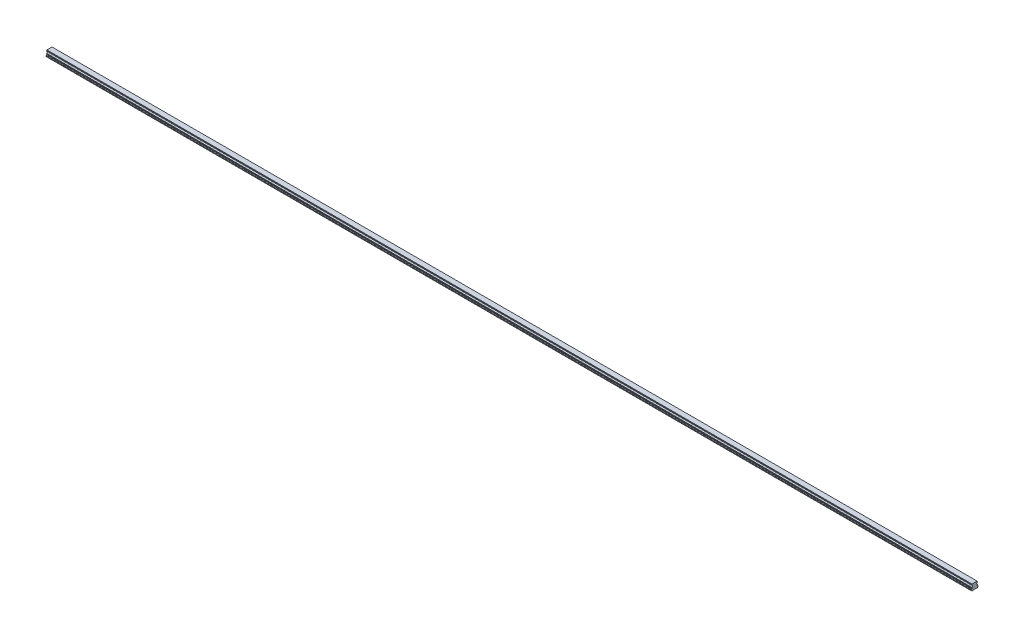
from build123d import *

# Parameters (mm, degrees)
BOSS_EXTRUDE1_DEPTH        = 3360
SKETCH3_R                  = 3
SKETCH3_R_2                = 2.5
CUT_EXTRUDE3_DEPTH         = 12
SKETCH3_2_R                = 2.5
CUT_EXTRUDE4_DEPTH         = 15
CHAMFER1_SIZE              = 0.5
LPATTERN4_COUNT            = 56
LPATTERN4_PITCH            = 60
CHAMFER1_OF_LPATTERN4_SIZE = 0.5


with BuildPart() as part:
    # Sketch1 → Boss-Extrude1 (new body)
    with BuildSketch(Plane(origin=(0, 0, 0), x_dir=(0, 0, -1), z_dir=(1, 0, 0))):
        with BuildLine():
            Line((9.375, 21.8), (-9.375, 21.8))
            Line((-9.375, 21.8), (-9.375, 20.756))
            Line((-9.375, 20.756), (-10, 19.415683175))
            Line((-10, 19.415683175), (-10, 17.685449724))
            ThreePointArc((-10, 17.685449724), (-7.2, 14.6), (-10, 11.514550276))
            Line((-10, 11.514550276), (-10, 9.784316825))
            Line((-10, 9.784316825), (-9.375, 8.444))
            Line((-9.375, 8.444), (-9.922688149, 6.4))
            Line((-9.922688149, 6.4), (-12.5, 5.489338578))
            Line((-12.5, 5.489338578), (-12.5, 2.65))
            Line((-12.5, 2.65), (-9.85, 0))
            Line((-9.85, 0), (-5.5, 0))
            Line((-5.5, 0), (-5, 0.5))
            Line((-5, 0.5), (5, 0.5))
            Line((5, 0.5), (5.5, 0))
            Line((5.5, 0), (9.85, 0))
            Line((9.85, 0), (12.5, 2.65))
            Line((12.5, 2.65), (12.5, 5.489338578))
            Line((12.5, 5.489338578), (9.922688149, 6.4))
            Line((9.922688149, 6.4), (9.375, 8.444))
            Line((9.375, 8.444), (10, 9.784316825))
            Line((10, 9.784316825), (10, 11.514550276))
            ThreePointArc((10, 11.514550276), (7.2, 14.6), (10, 17.685449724))
            Line((10, 17.685449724), (10, 19.415683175))
            Line((10, 19.415683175), (9.375, 20.756))
            Line((9.375, 20.756), (9.375, 21.8))
        make_face()
    extrude(amount=BOSS_EXTRUDE1_DEPTH)

    # Sketch3 → Cut-Extrude3 (cut)
    with BuildSketch(Plane.XZ):
        with Locations(Location((30, 0, 0), (0, 0, 270))):
            Circle(SKETCH3_R)
        with Locations(Location((30, 0, 0), (0, 0, 270))):
            Circle(SKETCH3_R_2, mode=Mode.SUBTRACT)
    cut_extrude3 = extrude(amount=-CUT_EXTRUDE3_DEPTH, mode=Mode.SUBTRACT)

    # Sketch3_2 → Cut-Extrude4 (cut)
    with BuildSketch(Plane.XZ):
        with Locations(Location((30, 0, 0), (0, 0, 270))):
            Circle(SKETCH3_2_R)
    cut_extrude4 = extrude(amount=-CUT_EXTRUDE4_DEPTH, mode=Mode.SUBTRACT)

    # Cut-Extrude5 cone 1 section (on through the dimple's axis) → Cut-Extrude5 (revolve, cut)
    with BuildSketch(Plane(origin=(30, 15, 0), x_dir=(0, 0, -1), z_dir=(1, 0, 0))):
        Polygon((0, 0), (2.5, 0), (0, 1.443375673), align=None)
    cut_extrude5 = revolve(axis=Axis((30, 15, 0), (0, 1, 0)), mode=Mode.SUBTRACT)

    # Chamfer1
    chamfer1_edges = [part.edges().sort_by_distance(p)[0] for p in [
        (30, 0.5, 3),
    ]]
    chamfer(chamfer1_edges, length=CHAMFER1_SIZE)

    # LPattern4: Cut-Extrude3, Cut-Extrude4, Cut-Extrude5 ×56
    with Locations(*[(i * LPATTERN4_PITCH, 0, 0) for i in range(1, LPATTERN4_COUNT)]):
        add(cut_extrude3, mode=Mode.SUBTRACT)
        add(cut_extrude4, mode=Mode.SUBTRACT)
        add(cut_extrude5, mode=Mode.SUBTRACT)

    # Chamfer1 of LPattern4
    chamfer1_of_lpattern4_edges = [part.edges().sort_by_distance(p)[0] for p in [
        (90, 0.5, 3),
        (150, 0.5, 3),
        (210, 0.5, 3),
        (270, 0.5, 3),
        (330, 0.5, 3),
        (390, 0.5, 3),
        (450, 0.5, 3),
        (510, 0.5, 3),
        (570, 0.5, 3),
        (630, 0.5, 3),
        (690, 0.5, 3),
        (750, 0.5, 3),
        (810, 0.5, 3),
        (870, 0.5, 3),
        (930, 0.5, 3),
        (990, 0.5, 3),
        (1050, 0.5, 3),
        (1110, 0.5, 3),
        (1170, 0.5, 3),
        (1230, 0.5, 3),
        (1290, 0.5, 3),
        (1350, 0.5, 3),
        (1410, 0.5, 3),
        (1470, 0.5, 3),
        (1530, 0.5, 3),
        (1590, 0.5, 3),
        (1650, 0.5, 3),
        (1710, 0.5, 3),
        (1770, 0.5, 3),
        (1830, 0.5, 3),
        (1890, 0.5, 3),
        (1950, 0.5, 3),
        (2010, 0.5, 3),
        (2070, 0.5, 3),
        (2130, 0.5, 3),
        (2190, 0.5, 3),
        (2250, 0.5, 3),
        (2310, 0.5, 3),
        (2370, 0.5, 3),
        (2430, 0.5, 3),
        (2490, 0.5, 3),
        (2550, 0.5, 3),
        (2610, 0.5, 3),
        (2670, 0.5, 3),
        (2730, 0.5, 3),
        (2790, 0.5, 3),
        (2850, 0.5, 3),
        (2910, 0.5, 3),
        (2970, 0.5, 3),
        (3030, 0.5, 3),
        (3090, 0.5, 3),
        (3150, 0.5, 3),
        (3210, 0.5, 3),
        (3270, 0.5, 3),
        (3330, 0.5, 3),
    ]]
    chamfer(chamfer1_of_lpattern4_edges, length=CHAMFER1_OF_LPATTERN4_SIZE)


solid = part.part
